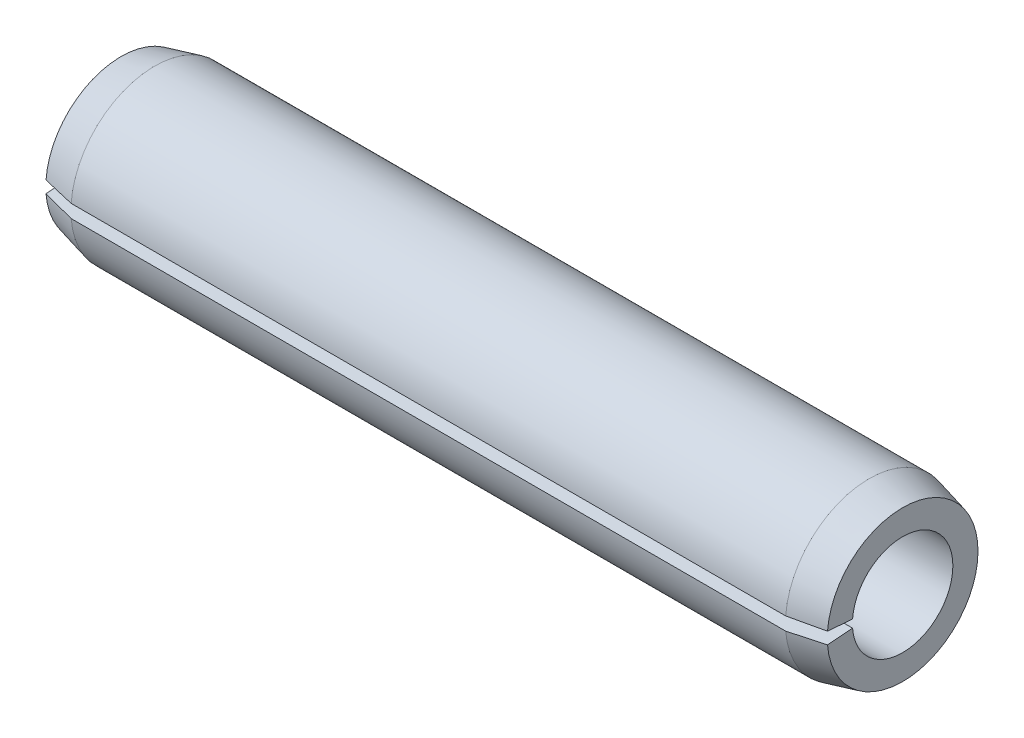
ISO-10303-21;
HEADER;
FILE_DESCRIPTION(('STEP AP214'),'2;1');
FILE_NAME('part.step','',(''),(''),'','','');
FILE_SCHEMA(('AUTOMOTIVE_DESIGN { 1 0 10303 214 1 1 1 1 }'));
ENDSEC;
DATA;
#1=APPLICATION_CONTEXT('core data for automotive mechanical design processes');
#2=APPLICATION_PROTOCOL_DEFINITION('international standard','automotive_design',2000,#1);
#3=PRODUCT_CONTEXT('',#1,'mechanical');
#4=PRODUCT('Part','Part','',(#3));
#5=PRODUCT_RELATED_PRODUCT_CATEGORY('part','',(#4));
#6=PRODUCT_DEFINITION_FORMATION('','',#4);
#7=PRODUCT_DEFINITION_CONTEXT('part definition',#1,'design');
#8=PRODUCT_DEFINITION('design','',#6,#7);
#9=PRODUCT_DEFINITION_SHAPE('','',#8);
#10=(LENGTH_UNIT() NAMED_UNIT(*) SI_UNIT(.MILLI.,.METRE.));
#11=(NAMED_UNIT(*) PLANE_ANGLE_UNIT() SI_UNIT($,.RADIAN.));
#12=(NAMED_UNIT(*) SI_UNIT($,.STERADIAN.) SOLID_ANGLE_UNIT());
#13=UNCERTAINTY_MEASURE_WITH_UNIT(LENGTH_MEASURE(1.E-05),#10,'distance_accuracy_value','');
#14=(GEOMETRIC_REPRESENTATION_CONTEXT(3) GLOBAL_UNCERTAINTY_ASSIGNED_CONTEXT((#13)) GLOBAL_UNIT_ASSIGNED_CONTEXT((#10,
#11,#12)) REPRESENTATION_CONTEXT('',''));
#15=CARTESIAN_POINT('',(0.,0.,0.));
#16=DIRECTION('',(0.,0.,1.));
#17=DIRECTION('',(1.,0.,0.));
#18=AXIS2_PLACEMENT_3D('',#15,#16,#17);
#19=CARTESIAN_POINT('',(0.,2.7,0.));
#20=DIRECTION('',(1.,0.,0.));
#21=DIRECTION('',(0.,0.,-1.));
#22=AXIS2_PLACEMENT_3D('',#19,#20,#21);
#23=PLANE('',#22);
#24=DIRECTION('',(0.,0.0784590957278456,0.996917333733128));
#25=VECTOR('',#24,1.);
#26=CARTESIAN_POINT('',(0.,0.,0.));
#27=LINE('',#26,#25);
#28=CARTESIAN_POINT('',(0.,0.141226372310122,1.79445120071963));
#29=VERTEX_POINT('',#28);
#30=CARTESIAN_POINT('',(0.,0.211839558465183,2.69167680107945));
#31=VERTEX_POINT('',#30);
#32=EDGE_CURVE('E81',#29,#31,#27,.T.);
#33=ORIENTED_EDGE('',*,*,#32,.T.);
#34=CARTESIAN_POINT('',(0.,0.,0.));
#35=DIRECTION('',(-1.,0.,0.));
#36=DIRECTION('',(0.,0.,1.));
#37=AXIS2_PLACEMENT_3D('',#34,#35,#36);
#38=CIRCLE('',#37,2.7);
#39=CARTESIAN_POINT('',(0.,-0.211839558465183,2.69167680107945));
#40=VERTEX_POINT('',#39);
#41=EDGE_CURVE('E99',#31,#40,#38,.T.);
#42=ORIENTED_EDGE('',*,*,#41,.T.);
#43=DIRECTION('',(0.,-0.0784590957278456,0.996917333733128));
#44=VECTOR('',#43,1.);
#45=CARTESIAN_POINT('',(0.,0.,0.));
#46=LINE('',#45,#44);
#47=CARTESIAN_POINT('',(0.,-0.141226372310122,1.79445120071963));
#48=VERTEX_POINT('',#47);
#49=EDGE_CURVE('E53',#48,#40,#46,.T.);
#50=ORIENTED_EDGE('',*,*,#49,.F.);
#51=CARTESIAN_POINT('',(0.,0.,0.));
#52=DIRECTION('',(-1.,0.,0.));
#53=DIRECTION('',(0.,0.,1.));
#54=AXIS2_PLACEMENT_3D('',#51,#52,#53);
#55=CIRCLE('',#54,1.8);
#56=EDGE_CURVE('E96',#29,#48,#55,.T.);
#57=ORIENTED_EDGE('',*,*,#56,.F.);
#58=EDGE_LOOP('',(#33,#42,#50,#57));
#59=FACE_BOUND('',#58,.T.);
#60=ADVANCED_FACE('F32',(#59),#23,.F.);
#61=CARTESIAN_POINT('',(-9.52499999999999,0.,0.));
#62=DIRECTION('',(-1.,0.,0.));
#63=DIRECTION('',(0.,0.,1.));
#64=AXIS2_PLACEMENT_3D('',#61,#62,#63);
#65=CYLINDRICAL_SURFACE('',#64,1.8);
#66=DIRECTION('',(-1.,0.,0.));
#67=VECTOR('',#66,1.);
#68=CARTESIAN_POINT('',(-9.52499999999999,0.141226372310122,1.79445120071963));
#69=LINE('',#68,#67);
#70=CARTESIAN_POINT('',(28.,0.141226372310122,1.79445120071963));
#71=VERTEX_POINT('',#70);
#72=EDGE_CURVE('E84',#29,#71,#69,.F.);
#73=ORIENTED_EDGE('',*,*,#72,.F.);
#74=ORIENTED_EDGE('',*,*,#56,.T.);
#75=DIRECTION('',(-1.,0.,0.));
#76=VECTOR('',#75,1.);
#77=CARTESIAN_POINT('',(-9.52499999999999,-0.141226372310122,1.79445120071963));
#78=LINE('',#77,#76);
#79=CARTESIAN_POINT('',(28.,-0.141226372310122,1.79445120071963));
#80=VERTEX_POINT('',#79);
#81=EDGE_CURVE('E117',#48,#80,#78,.F.);
#82=ORIENTED_EDGE('',*,*,#81,.T.);
#83=CARTESIAN_POINT('',(28.,0.,0.));
#84=DIRECTION('',(-1.,0.,0.));
#85=DIRECTION('',(0.,0.,1.));
#86=AXIS2_PLACEMENT_3D('',#83,#84,#85);
#87=CIRCLE('',#86,1.8);
#88=EDGE_CURVE('E98',#71,#80,#87,.T.);
#89=ORIENTED_EDGE('',*,*,#88,.F.);
#90=EDGE_LOOP('',(#73,#74,#82,#89));
#91=FACE_BOUND('',#90,.T.);
#92=ADVANCED_FACE('F94',(#91),#65,.F.);
#93=CARTESIAN_POINT('',(28.,1.8,0.));
#94=DIRECTION('',(-1.,0.,0.));
#95=DIRECTION('',(0.,0.,1.));
#96=AXIS2_PLACEMENT_3D('',#93,#94,#95);
#97=PLANE('',#96);
#98=DIRECTION('',(0.,0.0784590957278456,0.996917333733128));
#99=VECTOR('',#98,1.);
#100=CARTESIAN_POINT('',(28.,0.,0.));
#101=LINE('',#100,#99);
#102=CARTESIAN_POINT('',(28.,0.211839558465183,2.69167680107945));
#103=VERTEX_POINT('',#102);
#104=EDGE_CURVE('E128',#71,#103,#101,.T.);
#105=ORIENTED_EDGE('',*,*,#104,.F.);
#106=ORIENTED_EDGE('',*,*,#88,.T.);
#107=DIRECTION('',(0.,-0.0784590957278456,0.996917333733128));
#108=VECTOR('',#107,1.);
#109=CARTESIAN_POINT('',(28.,0.,0.));
#110=LINE('',#109,#108);
#111=CARTESIAN_POINT('',(28.,-0.211839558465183,2.69167680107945));
#112=VERTEX_POINT('',#111);
#113=EDGE_CURVE('E125',#80,#112,#110,.T.);
#114=ORIENTED_EDGE('',*,*,#113,.T.);
#115=CARTESIAN_POINT('',(28.,0.,0.));
#116=DIRECTION('',(-1.,0.,0.));
#117=DIRECTION('',(0.,0.,1.));
#118=AXIS2_PLACEMENT_3D('',#115,#116,#117);
#119=CIRCLE('',#118,2.7);
#120=EDGE_CURVE('E103',#103,#112,#119,.T.);
#121=ORIENTED_EDGE('',*,*,#120,.F.);
#122=EDGE_LOOP('',(#105,#106,#114,#121));
#123=FACE_BOUND('',#122,.T.);
#124=ADVANCED_FACE('F136',(#123),#97,.F.);
#125=CARTESIAN_POINT('',(28.,0.,0.));
#126=DIRECTION('',(-1.,0.,0.));
#127=DIRECTION('',(0.,0.,1.));
#128=AXIS2_PLACEMENT_3D('',#125,#126,#127);
#129=CONICAL_SURFACE('',#128,2.7,0.244978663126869);
#130=DIRECTION('',(-0.970142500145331,0.0190291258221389,0.241787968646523));
#131=VECTOR('',#130,1.);
#132=CARTESIAN_POINT('',(38.7999999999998,0.,0.));
#133=LINE('',#132,#131);
#134=CARTESIAN_POINT('',(26.8,0.235377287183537,2.99075200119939));
#135=VERTEX_POINT('',#134);
#136=EDGE_CURVE('E100',#103,#135,#133,.T.);
#137=ORIENTED_EDGE('',*,*,#136,.F.);
#138=ORIENTED_EDGE('',*,*,#120,.T.);
#139=DIRECTION('',(-0.970142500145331,-0.0190291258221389,0.241787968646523));
#140=VECTOR('',#139,1.);
#141=CARTESIAN_POINT('',(38.7999999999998,0.,0.));
#142=LINE('',#141,#140);
#143=CARTESIAN_POINT('',(26.8,-0.235377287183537,2.99075200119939));
#144=VERTEX_POINT('',#143);
#145=EDGE_CURVE('E119',#112,#144,#142,.T.);
#146=ORIENTED_EDGE('',*,*,#145,.T.);
#147=CARTESIAN_POINT('',(26.8,0.,0.));
#148=DIRECTION('',(-1.,0.,0.));
#149=DIRECTION('',(0.,0.,1.));
#150=AXIS2_PLACEMENT_3D('',#147,#148,#149);
#151=CIRCLE('',#150,3.);
#152=EDGE_CURVE('E108',#135,#144,#151,.T.);
#153=ORIENTED_EDGE('',*,*,#152,.F.);
#154=EDGE_LOOP('',(#137,#138,#146,#153));
#155=FACE_BOUND('',#154,.T.);
#156=ADVANCED_FACE('F135',(#155),#129,.T.);
#157=CARTESIAN_POINT('',(-9.52499999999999,0.,0.));
#158=DIRECTION('',(-1.,0.,0.));
#159=DIRECTION('',(0.,0.,1.));
#160=AXIS2_PLACEMENT_3D('',#157,#158,#159);
#161=CYLINDRICAL_SURFACE('',#160,3.);
#162=DIRECTION('',(-1.,0.,0.));
#163=VECTOR('',#162,1.);
#164=CARTESIAN_POINT('',(-9.52499999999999,0.235377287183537,2.99075200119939));
#165=LINE('',#164,#163);
#166=CARTESIAN_POINT('',(1.2,0.235377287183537,2.99075200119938));
#167=VERTEX_POINT('',#166);
#168=EDGE_CURVE('E45',#135,#167,#165,.T.);
#169=ORIENTED_EDGE('',*,*,#168,.F.);
#170=ORIENTED_EDGE('',*,*,#152,.T.);
#171=DIRECTION('',(-1.,0.,0.));
#172=VECTOR('',#171,1.);
#173=CARTESIAN_POINT('',(-9.52499999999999,-0.235377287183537,2.99075200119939));
#174=LINE('',#173,#172);
#175=CARTESIAN_POINT('',(1.2,-0.235377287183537,2.99075200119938));
#176=VERTEX_POINT('',#175);
#177=EDGE_CURVE('E122',#144,#176,#174,.T.);
#178=ORIENTED_EDGE('',*,*,#177,.T.);
#179=CARTESIAN_POINT('',(1.2,0.,0.));
#180=DIRECTION('',(-1.,0.,0.));
#181=DIRECTION('',(0.,0.,1.));
#182=AXIS2_PLACEMENT_3D('',#179,#180,#181);
#183=CIRCLE('',#182,3.);
#184=EDGE_CURVE('E111',#167,#176,#183,.T.);
#185=ORIENTED_EDGE('',*,*,#184,.F.);
#186=EDGE_LOOP('',(#169,#170,#178,#185));
#187=FACE_BOUND('',#186,.T.);
#188=ADVANCED_FACE('F139',(#187),#161,.T.);
#189=CARTESIAN_POINT('',(1.2,0.,0.));
#190=DIRECTION('',(1.,0.,0.));
#191=DIRECTION('',(0.,0.,-1.));
#192=AXIS2_PLACEMENT_3D('',#189,#190,#191);
#193=CONICAL_SURFACE('',#192,3.,0.244978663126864);
#194=DIRECTION('',(-0.970142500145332,-0.0190291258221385,-0.241787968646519));
#195=VECTOR('',#194,1.);
#196=CARTESIAN_POINT('',(-10.8,0.,0.));
#197=LINE('',#196,#195);
#198=EDGE_CURVE('E11',#167,#31,#197,.T.);
#199=ORIENTED_EDGE('',*,*,#198,.F.);
#200=ORIENTED_EDGE('',*,*,#184,.T.);
#201=DIRECTION('',(-0.970142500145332,0.0190291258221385,-0.241787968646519));
#202=VECTOR('',#201,1.);
#203=CARTESIAN_POINT('',(-10.8,0.,0.));
#204=LINE('',#203,#202);
#205=EDGE_CURVE('E39',#176,#40,#204,.T.);
#206=ORIENTED_EDGE('',*,*,#205,.T.);
#207=ORIENTED_EDGE('',*,*,#41,.F.);
#208=EDGE_LOOP('',(#199,#200,#206,#207));
#209=FACE_BOUND('',#208,.T.);
#210=ADVANCED_FACE('F142',(#209),#193,.T.);
#211=CARTESIAN_POINT('',(28.,0.,0.));
#212=DIRECTION('',(0.,-0.996917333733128,-0.0784590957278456));
#213=DIRECTION('',(0.,0.0784590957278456,-0.996917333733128));
#214=AXIS2_PLACEMENT_3D('',#211,#212,#213);
#215=PLANE('',#214);
#216=ORIENTED_EDGE('',*,*,#49,.T.);
#217=ORIENTED_EDGE('',*,*,#205,.F.);
#218=ORIENTED_EDGE('',*,*,#177,.F.);
#219=ORIENTED_EDGE('',*,*,#145,.F.);
#220=ORIENTED_EDGE('',*,*,#113,.F.);
#221=ORIENTED_EDGE('',*,*,#81,.F.);
#222=EDGE_LOOP('',(#216,#217,#218,#219,#220,#221));
#223=FACE_BOUND('',#222,.T.);
#224=ADVANCED_FACE('F137',(#223),#215,.F.);
#225=CARTESIAN_POINT('',(28.,0.,0.));
#226=DIRECTION('',(0.,-0.996917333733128,0.0784590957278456));
#227=DIRECTION('',(0.,-0.0784590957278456,-0.996917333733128));
#228=AXIS2_PLACEMENT_3D('',#225,#226,#227);
#229=PLANE('',#228);
#230=ORIENTED_EDGE('',*,*,#72,.T.);
#231=ORIENTED_EDGE('',*,*,#104,.T.);
#232=ORIENTED_EDGE('',*,*,#136,.T.);
#233=ORIENTED_EDGE('',*,*,#168,.T.);
#234=ORIENTED_EDGE('',*,*,#198,.T.);
#235=ORIENTED_EDGE('',*,*,#32,.F.);
#236=EDGE_LOOP('',(#230,#231,#232,#233,#234,#235));
#237=FACE_BOUND('',#236,.T.);
#238=ADVANCED_FACE('F83',(#237),#229,.T.);
#239=CLOSED_SHELL('',(#60,#92,#124,#156,#188,#210,#224,#238));
#240=MANIFOLD_SOLID_BREP('B2',#239);
#241=ADVANCED_BREP_SHAPE_REPRESENTATION('',(#18,#240),#14);
#242=SHAPE_DEFINITION_REPRESENTATION(#9,#241);
ENDSEC;
END-ISO-10303-21;
